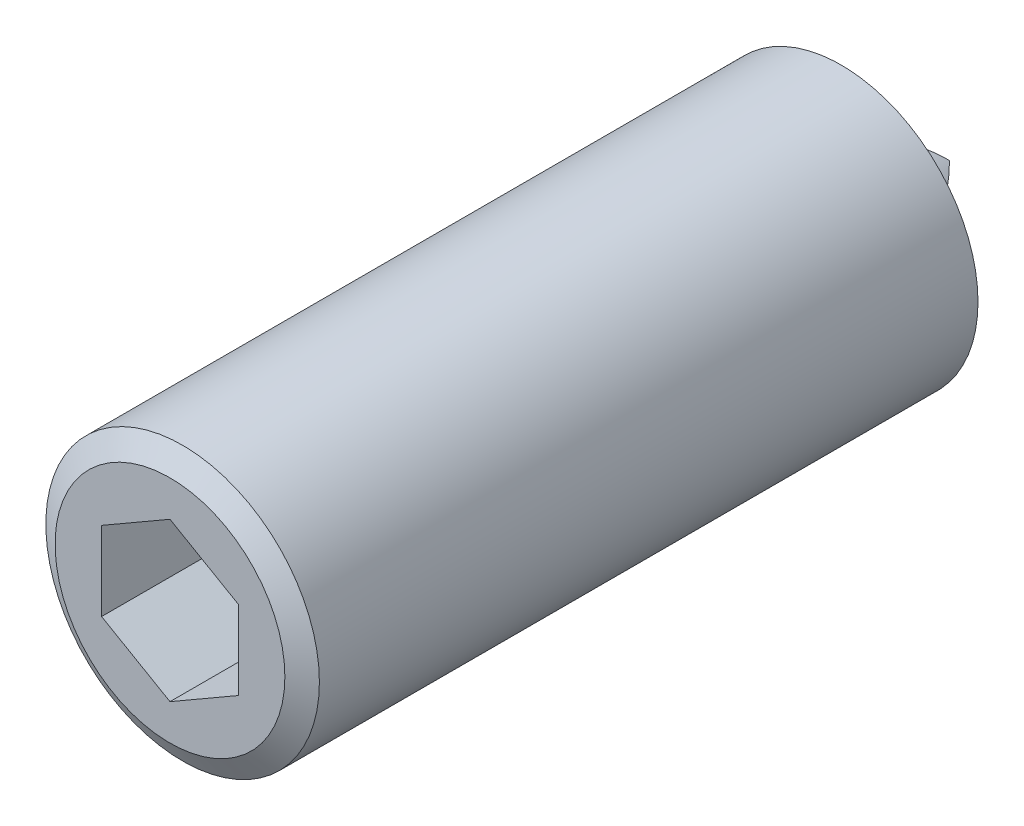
ISO-10303-21;
HEADER;
FILE_DESCRIPTION(('STEP AP214'),'2;1');
FILE_NAME('part.step','',(''),(''),'','','');
FILE_SCHEMA(('AUTOMOTIVE_DESIGN { 1 0 10303 214 1 1 1 1 }'));
ENDSEC;
DATA;
#1=APPLICATION_CONTEXT('core data for automotive mechanical design processes');
#2=APPLICATION_PROTOCOL_DEFINITION('international standard','automotive_design',2000,#1);
#3=PRODUCT_CONTEXT('',#1,'mechanical');
#4=PRODUCT('Part','Part','',(#3));
#5=PRODUCT_RELATED_PRODUCT_CATEGORY('part','',(#4));
#6=PRODUCT_DEFINITION_FORMATION('','',#4);
#7=PRODUCT_DEFINITION_CONTEXT('part definition',#1,'design');
#8=PRODUCT_DEFINITION('design','',#6,#7);
#9=PRODUCT_DEFINITION_SHAPE('','',#8);
#10=(LENGTH_UNIT() NAMED_UNIT(*) SI_UNIT(.MILLI.,.METRE.));
#11=(NAMED_UNIT(*) PLANE_ANGLE_UNIT() SI_UNIT($,.RADIAN.));
#12=(NAMED_UNIT(*) SI_UNIT($,.STERADIAN.) SOLID_ANGLE_UNIT());
#13=UNCERTAINTY_MEASURE_WITH_UNIT(LENGTH_MEASURE(1.E-05),#10,'distance_accuracy_value','');
#14=(GEOMETRIC_REPRESENTATION_CONTEXT(3) GLOBAL_UNCERTAINTY_ASSIGNED_CONTEXT((#13)) GLOBAL_UNIT_ASSIGNED_CONTEXT((#10,
#11,#12)) REPRESENTATION_CONTEXT('',''));
#15=CARTESIAN_POINT('',(0.,0.,0.));
#16=DIRECTION('',(0.,0.,1.));
#17=DIRECTION('',(1.,0.,0.));
#18=AXIS2_PLACEMENT_3D('',#15,#16,#17);
#19=CARTESIAN_POINT('',(0.,-5.,0.));
#20=DIRECTION('',(0.70710678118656,0.,0.707106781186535));
#21=DIRECTION('',(0.707106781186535,0.,-0.70710678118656));
#22=AXIS2_PLACEMENT_3D('',#19,#20,#21);
#23=PLANE('',#22);
#24=DIRECTION('',(0.577350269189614,-0.577350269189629,-0.577350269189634));
#25=VECTOR('',#24,1.);
#26=CARTESIAN_POINT('',(0.899999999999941,-3.20000000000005,-0.9));
#27=LINE('',#26,#25);
#28=CARTESIAN_POINT('',(-1.15,-1.15,1.15));
#29=VERTEX_POINT('',#28);
#30=CARTESIAN_POINT('',(0.,-2.3,0.));
#31=VERTEX_POINT('',#30);
#32=EDGE_CURVE('E234',#29,#31,#27,.T.);
#33=ORIENTED_EDGE('',*,*,#32,.T.);
#34=DIRECTION('',(-0.57735026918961,-0.577350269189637,0.57735026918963));
#35=VECTOR('',#34,1.);
#36=CARTESIAN_POINT('',(-0.90000000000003,-3.2,0.9));
#37=LINE('',#36,#35);
#38=CARTESIAN_POINT('',(-0.798717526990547,-3.09871752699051,0.798717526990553));
#39=VERTEX_POINT('',#38);
#40=EDGE_CURVE('E226',#31,#39,#37,.T.);
#41=ORIENTED_EDGE('',*,*,#40,.T.);
#42=CARTESIAN_POINT('',(0.,0.,0.));
#43=DIRECTION('',(0.70710678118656,0.,0.707106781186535));
#44=DIRECTION('',(-0.707106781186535,0.,0.70710678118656));
#45=AXIS2_PLACEMENT_3D('',#42,#43,#44);
#46=ELLIPSE('',#45,4.52548339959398,3.2);
#47=CARTESIAN_POINT('',(-1.15000000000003,-2.98621834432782,1.15));
#48=VERTEX_POINT('',#47);
#49=EDGE_CURVE('E325',#48,#39,#46,.T.);
#50=ORIENTED_EDGE('',*,*,#49,.F.);
#51=DIRECTION('',(0.,1.,0.));
#52=VECTOR('',#51,1.);
#53=CARTESIAN_POINT('',(-1.15000000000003,-5.,1.15));
#54=LINE('',#53,#52);
#55=EDGE_CURVE('E257',#48,#29,#54,.T.);
#56=ORIENTED_EDGE('',*,*,#55,.T.);
#57=EDGE_LOOP('',(#33,#41,#50,#56));
#58=FACE_BOUND('',#57,.T.);
#59=ADVANCED_FACE('F14',(#58),#23,.F.);
#60=CARTESIAN_POINT('',(-0.798717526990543,3.09871752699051,0.798717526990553));
#61=VERTEX_POINT('',#60);
#62=CARTESIAN_POINT('',(-1.15000000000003,2.98621834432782,1.15));
#63=VERTEX_POINT('',#62);
#64=EDGE_CURVE('E328',#61,#63,#46,.T.);
#65=ORIENTED_EDGE('',*,*,#64,.F.);
#66=DIRECTION('',(0.577350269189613,-0.577350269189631,-0.577350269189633));
#67=VECTOR('',#66,1.);
#68=CARTESIAN_POINT('',(2.43333333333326,-0.1333333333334,-2.4333333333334));
#69=LINE('',#68,#67);
#70=CARTESIAN_POINT('',(0.,2.30000000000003,0.));
#71=VERTEX_POINT('',#70);
#72=EDGE_CURVE('E221',#61,#71,#69,.T.);
#73=ORIENTED_EDGE('',*,*,#72,.T.);
#74=DIRECTION('',(-0.577350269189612,-0.577350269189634,0.577350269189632));
#75=VECTOR('',#74,1.);
#76=CARTESIAN_POINT('',(-2.43333333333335,-0.133333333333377,2.4333333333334));
#77=LINE('',#76,#75);
#78=CARTESIAN_POINT('',(-1.15000000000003,1.15,1.15));
#79=VERTEX_POINT('',#78);
#80=EDGE_CURVE('E211',#71,#79,#77,.T.);
#81=ORIENTED_EDGE('',*,*,#80,.T.);
#82=EDGE_CURVE('E261',#79,#63,#54,.T.);
#83=ORIENTED_EDGE('',*,*,#82,.T.);
#84=EDGE_LOOP('',(#65,#73,#81,#83));
#85=FACE_BOUND('',#84,.T.);
#86=ADVANCED_FACE('F400',(#85),#23,.F.);
#87=CARTESIAN_POINT('',(-1.15000000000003,-5.,1.15));
#88=DIRECTION('',(-0.707106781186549,0.,0.707106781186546));
#89=DIRECTION('',(0.707106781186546,0.,0.707106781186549));
#90=AXIS2_PLACEMENT_3D('',#87,#88,#89);
#91=PLANE('',#90);
#92=CARTESIAN_POINT('',(0.,0.,2.3));
#93=DIRECTION('',(-0.707106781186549,0.,0.707106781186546));
#94=DIRECTION('',(0.707106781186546,0.,0.707106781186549));
#95=AXIS2_PLACEMENT_3D('',#92,#93,#94);
#96=ELLIPSE('',#95,4.52548339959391,3.2);
#97=CARTESIAN_POINT('',(-2.26274169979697,-2.26274169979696,0.0372583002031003));
#98=VERTEX_POINT('',#97);
#99=EDGE_CURVE('E329',#98,#48,#96,.T.);
#100=ORIENTED_EDGE('',*,*,#99,.F.);
#101=DIRECTION('',(0.577350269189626,0.577350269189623,0.577350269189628));
#102=VECTOR('',#101,1.);
#103=CARTESIAN_POINT('',(-2.43333333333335,-2.43333333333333,-0.133333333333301));
#104=LINE('',#103,#102);
#105=EDGE_CURVE('E240',#98,#29,#104,.T.);
#106=ORIENTED_EDGE('',*,*,#105,.T.);
#107=ORIENTED_EDGE('',*,*,#55,.F.);
#108=EDGE_LOOP('',(#100,#106,#107));
#109=FACE_BOUND('',#108,.T.);
#110=ADVANCED_FACE('F406',(#109),#91,.F.);
#111=ORIENTED_EDGE('',*,*,#82,.F.);
#112=DIRECTION('',(-0.577350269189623,0.577350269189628,-0.577350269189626));
#113=VECTOR('',#112,1.);
#114=CARTESIAN_POINT('',(0.89999999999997,-0.900000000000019,3.2));
#115=LINE('',#114,#113);
#116=CARTESIAN_POINT('',(-2.26274169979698,2.26274169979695,0.0372583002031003));
#117=VERTEX_POINT('',#116);
#118=EDGE_CURVE('E217',#79,#117,#115,.T.);
#119=ORIENTED_EDGE('',*,*,#118,.T.);
#120=EDGE_CURVE('E184',#63,#117,#96,.T.);
#121=ORIENTED_EDGE('',*,*,#120,.F.);
#122=EDGE_LOOP('',(#111,#119,#121));
#123=FACE_BOUND('',#122,.T.);
#124=ADVANCED_FACE('F421',(#123),#91,.F.);
#125=CARTESIAN_POINT('',(1.14999999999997,-5.,1.15));
#126=DIRECTION('',(0.707106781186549,0.,0.707106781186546));
#127=DIRECTION('',(0.707106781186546,0.,-0.707106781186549));
#128=AXIS2_PLACEMENT_3D('',#125,#126,#127);
#129=PLANE('',#128);
#130=DIRECTION('',(0.,1.,0.));
#131=VECTOR('',#130,1.);
#132=CARTESIAN_POINT('',(1.14999999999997,-5.,1.15));
#133=LINE('',#132,#131);
#134=CARTESIAN_POINT('',(1.14999999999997,-2.98621834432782,1.15));
#135=VERTEX_POINT('',#134);
#136=CARTESIAN_POINT('',(1.15000000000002,-1.15,1.15));
#137=VERTEX_POINT('',#136);
#138=EDGE_CURVE('E262',#135,#137,#133,.T.);
#139=ORIENTED_EDGE('',*,*,#138,.T.);
#140=DIRECTION('',(0.577350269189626,-0.577350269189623,-0.577350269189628));
#141=VECTOR('',#140,1.);
#142=CARTESIAN_POINT('',(2.43333333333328,-2.43333333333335,-0.133333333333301));
#143=LINE('',#142,#141);
#144=CARTESIAN_POINT('',(2.2627416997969,-2.26274169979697,0.0372583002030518));
#145=VERTEX_POINT('',#144);
#146=EDGE_CURVE('E231',#137,#145,#143,.T.);
#147=ORIENTED_EDGE('',*,*,#146,.T.);
#148=CARTESIAN_POINT('',(0.,0.,2.3));
#149=DIRECTION('',(0.707106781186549,0.,0.707106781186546));
#150=DIRECTION('',(-0.707106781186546,0.,0.707106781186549));
#151=AXIS2_PLACEMENT_3D('',#148,#149,#150);
#152=ELLIPSE('',#151,4.52548339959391,3.2);
#153=EDGE_CURVE('E317',#135,#145,#152,.T.);
#154=ORIENTED_EDGE('',*,*,#153,.F.);
#155=EDGE_LOOP('',(#139,#147,#154));
#156=FACE_BOUND('',#155,.T.);
#157=ADVANCED_FACE('F435',(#156),#129,.F.);
#158=CARTESIAN_POINT('',(2.2627416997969,2.26274169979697,0.0372583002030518));
#159=VERTEX_POINT('',#158);
#160=CARTESIAN_POINT('',(1.14999999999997,2.98621834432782,1.15));
#161=VERTEX_POINT('',#160);
#162=EDGE_CURVE('E322',#159,#161,#152,.T.);
#163=ORIENTED_EDGE('',*,*,#162,.F.);
#164=DIRECTION('',(-0.577350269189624,-0.577350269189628,0.577350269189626));
#165=VECTOR('',#164,1.);
#166=CARTESIAN_POINT('',(-0.900000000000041,-0.9,3.2));
#167=LINE('',#166,#165);
#168=CARTESIAN_POINT('',(1.15,1.15,1.15));
#169=VERTEX_POINT('',#168);
#170=EDGE_CURVE('E208',#159,#169,#167,.T.);
#171=ORIENTED_EDGE('',*,*,#170,.T.);
#172=EDGE_CURVE('E264',#169,#161,#133,.T.);
#173=ORIENTED_EDGE('',*,*,#172,.T.);
#174=EDGE_LOOP('',(#163,#171,#173));
#175=FACE_BOUND('',#174,.T.);
#176=ADVANCED_FACE('F440',(#175),#129,.F.);
#177=CARTESIAN_POINT('',(0.,-5.,0.));
#178=DIRECTION('',(-0.707106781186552,0.,0.707106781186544));
#179=DIRECTION('',(0.707106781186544,0.,0.707106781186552));
#180=AXIS2_PLACEMENT_3D('',#177,#178,#179);
#181=PLANE('',#180);
#182=CARTESIAN_POINT('',(0.,0.,0.));
#183=DIRECTION('',(-0.707106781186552,0.,0.707106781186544));
#184=DIRECTION('',(0.707106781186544,0.,0.707106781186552));
#185=AXIS2_PLACEMENT_3D('',#182,#183,#184);
#186=ELLIPSE('',#185,4.52548339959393,3.2);
#187=CARTESIAN_POINT('',(0.798717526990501,-3.0987175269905,0.798717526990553));
#188=VERTEX_POINT('',#187);
#189=EDGE_CURVE('E315',#188,#135,#186,.T.);
#190=ORIENTED_EDGE('',*,*,#189,.F.);
#191=DIRECTION('',(-0.577350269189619,0.577350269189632,-0.577350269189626));
#192=VECTOR('',#191,1.);
#193=CARTESIAN_POINT('',(0.899999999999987,-3.2,0.9));
#194=LINE('',#193,#192);
#195=EDGE_CURVE('E340',#188,#31,#194,.T.);
#196=ORIENTED_EDGE('',*,*,#195,.T.);
#197=DIRECTION('',(0.577350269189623,0.577350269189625,0.57735026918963));
#198=VECTOR('',#197,1.);
#199=CARTESIAN_POINT('',(-0.9,-3.2,-0.9));
#200=LINE('',#199,#198);
#201=EDGE_CURVE('E189',#31,#137,#200,.T.);
#202=ORIENTED_EDGE('',*,*,#201,.T.);
#203=ORIENTED_EDGE('',*,*,#138,.F.);
#204=EDGE_LOOP('',(#190,#196,#202,#203));
#205=FACE_BOUND('',#204,.T.);
#206=ADVANCED_FACE('F416',(#205),#181,.F.);
#207=DIRECTION('',(-0.577350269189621,0.577350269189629,-0.577350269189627));
#208=VECTOR('',#207,1.);
#209=CARTESIAN_POINT('',(2.43333333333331,-0.133333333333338,2.43333333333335));
#210=LINE('',#209,#208);
#211=EDGE_CURVE('E183',#169,#71,#210,.T.);
#212=ORIENTED_EDGE('',*,*,#211,.T.);
#213=DIRECTION('',(0.577350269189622,0.577350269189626,0.577350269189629));
#214=VECTOR('',#213,1.);
#215=CARTESIAN_POINT('',(-2.43333333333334,-0.133333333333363,-2.43333333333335));
#216=LINE('',#215,#214);
#217=CARTESIAN_POINT('',(0.798717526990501,3.0987175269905,0.798717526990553));
#218=VERTEX_POINT('',#217);
#219=EDGE_CURVE('E190',#71,#218,#216,.T.);
#220=ORIENTED_EDGE('',*,*,#219,.T.);
#221=EDGE_CURVE('E318',#161,#218,#186,.T.);
#222=ORIENTED_EDGE('',*,*,#221,.F.);
#223=ORIENTED_EDGE('',*,*,#172,.F.);
#224=EDGE_LOOP('',(#212,#220,#222,#223));
#225=FACE_BOUND('',#224,.T.);
#226=ADVANCED_FACE('F417',(#225),#181,.F.);
#227=CARTESIAN_POINT('',(0.,0.,46.27));
#228=DIRECTION('',(0.,0.,1.));
#229=DIRECTION('',(1.,0.,0.));
#230=AXIS2_PLACEMENT_3D('',#227,#228,#229);
#231=CYLINDRICAL_SURFACE('',#230,3.2);
#232=CARTESIAN_POINT('',(0.,0.,1.27));
#233=DIRECTION('',(0.,0.,1.));
#234=DIRECTION('',(1.,0.,0.));
#235=AXIS2_PLACEMENT_3D('',#232,#233,#234);
#236=CIRCLE('',#235,3.2);
#237=CARTESIAN_POINT('',(3.19999999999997,0.,1.27));
#238=VERTEX_POINT('',#237);
#239=EDGE_CURVE('E312',#238,#238,#236,.T.);
#240=ORIENTED_EDGE('',*,*,#239,.F.);
#241=EDGE_LOOP('',(#240));
#242=FACE_BOUND('',#241,.T.);
#243=CARTESIAN_POINT('',(0.,0.,-2.3));
#244=DIRECTION('',(0.707106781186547,0.,0.707106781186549));
#245=DIRECTION('',(-0.707106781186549,0.,0.707106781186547));
#246=AXIS2_PLACEMENT_3D('',#243,#244,#245);
#247=ELLIPSE('',#246,4.5254833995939,3.2);
#248=CARTESIAN_POINT('',(-3.09871752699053,0.79871752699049,0.798717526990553));
#249=VERTEX_POINT('',#248);
#250=CARTESIAN_POINT('',(-3.09871752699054,-0.798717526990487,0.798717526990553));
#251=VERTEX_POINT('',#250);
#252=EDGE_CURVE('E331',#249,#251,#247,.T.);
#253=ORIENTED_EDGE('',*,*,#252,.T.);
#254=CARTESIAN_POINT('',(0.,0.,0.));
#255=DIRECTION('',(0.,0.707106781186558,0.707106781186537));
#256=DIRECTION('',(0.,-0.707106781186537,0.707106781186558));
#257=AXIS2_PLACEMENT_3D('',#254,#255,#256);
#258=ELLIPSE('',#257,4.52548339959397,3.2);
#259=CARTESIAN_POINT('',(-2.98621834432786,-1.15,1.15));
#260=VERTEX_POINT('',#259);
#261=EDGE_CURVE('E251',#251,#260,#258,.T.);
#262=ORIENTED_EDGE('',*,*,#261,.T.);
#263=CARTESIAN_POINT('',(0.,0.,2.3));
#264=DIRECTION('',(0.,-0.707106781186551,0.707106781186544));
#265=DIRECTION('',(0.,0.707106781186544,0.707106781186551));
#266=AXIS2_PLACEMENT_3D('',#263,#264,#265);
#267=ELLIPSE('',#266,4.52548339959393,3.2);
#268=EDGE_CURVE('E241',#260,#98,#267,.T.);
#269=ORIENTED_EDGE('',*,*,#268,.T.);
#270=ORIENTED_EDGE('',*,*,#99,.T.);
#271=ORIENTED_EDGE('',*,*,#49,.T.);
#272=CARTESIAN_POINT('',(0.,0.,-2.3));
#273=DIRECTION('',(0.,0.707106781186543,0.707106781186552));
#274=DIRECTION('',(0.,-0.707106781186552,0.707106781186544));
#275=AXIS2_PLACEMENT_3D('',#272,#273,#274);
#276=ELLIPSE('',#275,4.52548339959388,3.2);
#277=EDGE_CURVE('E229',#39,#188,#276,.T.);
#278=ORIENTED_EDGE('',*,*,#277,.T.);
#279=ORIENTED_EDGE('',*,*,#189,.T.);
#280=ORIENTED_EDGE('',*,*,#153,.T.);
#281=CARTESIAN_POINT('',(2.9862183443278,-1.15,1.15));
#282=VERTEX_POINT('',#281);
#283=EDGE_CURVE('E237',#145,#282,#267,.T.);
#284=ORIENTED_EDGE('',*,*,#283,.T.);
#285=CARTESIAN_POINT('',(3.09871752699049,-0.798717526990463,0.798717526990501));
#286=VERTEX_POINT('',#285);
#287=EDGE_CURVE('E167',#282,#286,#258,.T.);
#288=ORIENTED_EDGE('',*,*,#287,.T.);
#289=CARTESIAN_POINT('',(0.,0.,-2.3));
#290=DIRECTION('',(-0.707106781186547,0.,0.707106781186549));
#291=DIRECTION('',(0.707106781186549,0.,0.707106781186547));
#292=AXIS2_PLACEMENT_3D('',#289,#290,#291);
#293=ELLIPSE('',#292,4.5254833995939,3.2);
#294=CARTESIAN_POINT('',(3.09871752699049,0.79871752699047,0.798717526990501));
#295=VERTEX_POINT('',#294);
#296=EDGE_CURVE('E321',#286,#295,#293,.T.);
#297=ORIENTED_EDGE('',*,*,#296,.T.);
#298=CARTESIAN_POINT('',(0.,0.,0.));
#299=DIRECTION('',(0.,-0.707106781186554,0.707106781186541));
#300=DIRECTION('',(0.,0.707106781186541,0.707106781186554));
#301=AXIS2_PLACEMENT_3D('',#298,#299,#300);
#302=ELLIPSE('',#301,4.52548339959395,3.2);
#303=CARTESIAN_POINT('',(2.9862183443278,1.15,1.15));
#304=VERTEX_POINT('',#303);
#305=EDGE_CURVE('E195',#295,#304,#302,.T.);
#306=ORIENTED_EDGE('',*,*,#305,.T.);
#307=CARTESIAN_POINT('',(0.,0.,2.3));
#308=DIRECTION('',(0.,0.707106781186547,0.707106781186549));
#309=DIRECTION('',(0.,-0.707106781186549,0.707106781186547));
#310=AXIS2_PLACEMENT_3D('',#307,#308,#309);
#311=ELLIPSE('',#310,4.5254833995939,3.2);
#312=EDGE_CURVE('E214',#304,#159,#311,.T.);
#313=ORIENTED_EDGE('',*,*,#312,.T.);
#314=ORIENTED_EDGE('',*,*,#162,.T.);
#315=ORIENTED_EDGE('',*,*,#221,.T.);
#316=CARTESIAN_POINT('',(0.,0.,-2.3));
#317=DIRECTION('',(0.,-0.707106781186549,0.707106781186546));
#318=DIRECTION('',(0.,0.707106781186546,0.707106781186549));
#319=AXIS2_PLACEMENT_3D('',#316,#317,#318);
#320=ELLIPSE('',#319,4.52548339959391,3.2);
#321=EDGE_CURVE('E224',#218,#61,#320,.T.);
#322=ORIENTED_EDGE('',*,*,#321,.T.);
#323=ORIENTED_EDGE('',*,*,#64,.T.);
#324=ORIENTED_EDGE('',*,*,#120,.T.);
#325=CARTESIAN_POINT('',(-2.98621834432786,1.15,1.15));
#326=VERTEX_POINT('',#325);
#327=EDGE_CURVE('E218',#117,#326,#311,.T.);
#328=ORIENTED_EDGE('',*,*,#327,.T.);
#329=EDGE_CURVE('E199',#326,#249,#302,.T.);
#330=ORIENTED_EDGE('',*,*,#329,.T.);
#331=EDGE_LOOP('',(#253,#262,#269,#270,#271,#278,#279,#280,#284,#288,#297,#306,#313,#314,#315,
#322,#323,#324,#328,#330));
#332=FACE_BOUND('',#331,.T.);
#333=ADVANCED_FACE('F461',(#242,#332),#231,.T.);
#334=CARTESIAN_POINT('',(5.,0.,1.27));
#335=DIRECTION('',(0.,0.,-1.));
#336=DIRECTION('',(-1.,0.,0.));
#337=AXIS2_PLACEMENT_3D('',#334,#335,#336);
#338=PLANE('',#337);
#339=CARTESIAN_POINT('',(0.,0.,1.27));
#340=DIRECTION('',(0.,0.,-1.));
#341=DIRECTION('',(-1.,0.,0.));
#342=AXIS2_PLACEMENT_3D('',#339,#340,#341);
#343=CIRCLE('',#342,4.2);
#344=CARTESIAN_POINT('',(-4.20000000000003,0.,1.27));
#345=VERTEX_POINT('',#344);
#346=EDGE_CURVE('E9',#345,#345,#343,.T.);
#347=ORIENTED_EDGE('',*,*,#346,.T.);
#348=EDGE_LOOP('',(#347));
#349=FACE_BOUND('',#348,.T.);
#350=ORIENTED_EDGE('',*,*,#239,.T.);
#351=EDGE_LOOP('',(#350));
#352=FACE_BOUND('',#351,.T.);
#353=ADVANCED_FACE('F585',(#349,#352),#338,.T.);
#354=CARTESIAN_POINT('',(0.,0.,46.27));
#355=DIRECTION('',(0.,0.,1.));
#356=DIRECTION('',(1.,0.,0.));
#357=AXIS2_PLACEMENT_3D('',#354,#355,#356);
#358=CYLINDRICAL_SURFACE('',#357,5.);
#359=CARTESIAN_POINT('',(0.,0.,25.8081197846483));
#360=DIRECTION('',(0.,0.,1.));
#361=DIRECTION('',(1.,0.,0.));
#362=AXIS2_PLACEMENT_3D('',#359,#360,#361);
#363=CIRCLE('',#362,5.);
#364=CARTESIAN_POINT('',(4.99999999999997,0.,25.8081197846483));
#365=VERTEX_POINT('',#364);
#366=EDGE_CURVE('E22',#365,#365,#363,.F.);
#367=ORIENTED_EDGE('',*,*,#366,.T.);
#368=EDGE_LOOP('',(#367));
#369=FACE_BOUND('',#368,.T.);
#370=CARTESIAN_POINT('',(0.,0.,1.7318802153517));
#371=DIRECTION('',(0.,0.,-1.));
#372=DIRECTION('',(-1.,0.,0.));
#373=AXIS2_PLACEMENT_3D('',#370,#371,#372);
#374=CIRCLE('',#373,5.);
#375=CARTESIAN_POINT('',(-5.00000000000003,0.,1.7318802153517));
#376=VERTEX_POINT('',#375);
#377=EDGE_CURVE('E346',#376,#376,#374,.F.);
#378=ORIENTED_EDGE('',*,*,#377,.T.);
#379=EDGE_LOOP('',(#378));
#380=FACE_BOUND('',#379,.T.);
#381=ADVANCED_FACE('F351',(#369,#380),#358,.T.);
#382=CARTESIAN_POINT('',(0.,0.,26.27));
#383=DIRECTION('',(0.,0.,1.));
#384=DIRECTION('',(1.,0.,0.));
#385=AXIS2_PLACEMENT_3D('',#382,#383,#384);
#386=PLANE('',#385);
#387=CARTESIAN_POINT('',(0.,0.,26.27));
#388=DIRECTION('',(0.,0.,1.));
#389=DIRECTION('',(1.,0.,0.));
#390=AXIS2_PLACEMENT_3D('',#387,#388,#389);
#391=CIRCLE('',#390,4.2);
#392=CARTESIAN_POINT('',(4.19999999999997,0.,26.27));
#393=VERTEX_POINT('',#392);
#394=EDGE_CURVE('E343',#393,#393,#391,.T.);
#395=ORIENTED_EDGE('',*,*,#394,.T.);
#396=EDGE_LOOP('',(#395));
#397=FACE_BOUND('',#396,.T.);
#398=DIRECTION('',(0.86602540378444,-0.5,0.));
#399=VECTOR('',#398,1.);
#400=CARTESIAN_POINT('',(-2.5,-1.44337567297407,26.27));
#401=LINE('',#400,#399);
#402=CARTESIAN_POINT('',(-2.5,-1.44337567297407,26.27));
#403=VERTEX_POINT('',#402);
#404=CARTESIAN_POINT('',(0.,-2.88675134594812,26.27));
#405=VERTEX_POINT('',#404);
#406=EDGE_CURVE('E260',#403,#405,#401,.T.);
#407=ORIENTED_EDGE('',*,*,#406,.F.);
#408=DIRECTION('',(0.,-1.,0.));
#409=VECTOR('',#408,1.);
#410=CARTESIAN_POINT('',(-2.5,1.44337567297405,26.27));
#411=LINE('',#410,#409);
#412=CARTESIAN_POINT('',(-2.5,1.44337567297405,26.27));
#413=VERTEX_POINT('',#412);
#414=EDGE_CURVE('E278',#413,#403,#411,.T.);
#415=ORIENTED_EDGE('',*,*,#414,.F.);
#416=DIRECTION('',(0.866025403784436,0.5,0.));
#417=VECTOR('',#416,1.);
#418=CARTESIAN_POINT('',(-2.5,1.44337567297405,26.27));
#419=LINE('',#418,#417);
#420=CARTESIAN_POINT('',(0.,2.88675134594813,26.27));
#421=VERTEX_POINT('',#420);
#422=EDGE_CURVE('E275',#413,#421,#419,.T.);
#423=ORIENTED_EDGE('',*,*,#422,.T.);
#424=DIRECTION('',(-0.866025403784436,0.5,0.));
#425=VECTOR('',#424,1.);
#426=CARTESIAN_POINT('',(2.49999999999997,1.44337567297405,26.27));
#427=LINE('',#426,#425);
#428=CARTESIAN_POINT('',(2.49999999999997,1.44337567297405,26.27));
#429=VERTEX_POINT('',#428);
#430=EDGE_CURVE('E272',#429,#421,#427,.T.);
#431=ORIENTED_EDGE('',*,*,#430,.F.);
#432=DIRECTION('',(0.,-1.,0.));
#433=VECTOR('',#432,1.);
#434=CARTESIAN_POINT('',(2.49999999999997,1.44337567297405,26.27));
#435=LINE('',#434,#433);
#436=CARTESIAN_POINT('',(2.49999999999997,-1.44337567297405,26.27));
#437=VERTEX_POINT('',#436);
#438=EDGE_CURVE('E269',#429,#437,#435,.T.);
#439=ORIENTED_EDGE('',*,*,#438,.T.);
#440=DIRECTION('',(-0.866025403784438,-0.5,0.));
#441=VECTOR('',#440,1.);
#442=CARTESIAN_POINT('',(2.49999999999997,-1.44337567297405,26.27));
#443=LINE('',#442,#441);
#444=EDGE_CURVE('E266',#437,#405,#443,.T.);
#445=ORIENTED_EDGE('',*,*,#444,.T.);
#446=EDGE_LOOP('',(#407,#415,#423,#431,#439,#445));
#447=FACE_BOUND('',#446,.T.);
#448=ADVANCED_FACE('F360',(#397,#447),#386,.T.);
#449=CARTESIAN_POINT('',(-2.5,-1.44337567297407,22.27));
#450=DIRECTION('',(-0.5,-0.86602540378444,0.));
#451=DIRECTION('',(-0.86602540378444,0.5,0.));
#452=AXIS2_PLACEMENT_3D('',#449,#450,#451);
#453=PLANE('',#452);
#454=DIRECTION('',(0.,0.,1.));
#455=VECTOR('',#454,1.);
#456=CARTESIAN_POINT('',(-2.5,-1.44337567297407,22.27));
#457=LINE('',#456,#455);
#458=CARTESIAN_POINT('',(-2.5,-1.44337567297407,22.27));
#459=VERTEX_POINT('',#458);
#460=EDGE_CURVE('E310',#459,#403,#457,.T.);
#461=ORIENTED_EDGE('',*,*,#460,.T.);
#462=ORIENTED_EDGE('',*,*,#406,.T.);
#463=DIRECTION('',(0.,0.,1.));
#464=VECTOR('',#463,1.);
#465=CARTESIAN_POINT('',(0.,-2.88675134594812,22.27));
#466=LINE('',#465,#464);
#467=CARTESIAN_POINT('',(0.,-2.88675134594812,22.27));
#468=VERTEX_POINT('',#467);
#469=EDGE_CURVE('E299',#468,#405,#466,.T.);
#470=ORIENTED_EDGE('',*,*,#469,.F.);
#471=DIRECTION('',(0.86602540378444,-0.5,0.));
#472=VECTOR('',#471,1.);
#473=CARTESIAN_POINT('',(-2.5,-1.44337567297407,22.27));
#474=LINE('',#473,#472);
#475=EDGE_CURVE('E281',#459,#468,#474,.T.);
#476=ORIENTED_EDGE('',*,*,#475,.F.);
#477=EDGE_LOOP('',(#461,#462,#470,#476));
#478=FACE_BOUND('',#477,.T.);
#479=ADVANCED_FACE('F363',(#478),#453,.F.);
#480=CARTESIAN_POINT('',(-2.5,1.44337567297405,22.27));
#481=DIRECTION('',(-1.,0.,0.));
#482=DIRECTION('',(0.,0.,1.));
#483=AXIS2_PLACEMENT_3D('',#480,#481,#482);
#484=PLANE('',#483);
#485=DIRECTION('',(0.,0.,1.));
#486=VECTOR('',#485,1.);
#487=CARTESIAN_POINT('',(-2.5,1.44337567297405,22.27));
#488=LINE('',#487,#486);
#489=CARTESIAN_POINT('',(-2.5,1.44337567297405,22.27));
#490=VERTEX_POINT('',#489);
#491=EDGE_CURVE('E308',#490,#413,#488,.T.);
#492=ORIENTED_EDGE('',*,*,#491,.T.);
#493=ORIENTED_EDGE('',*,*,#414,.T.);
#494=ORIENTED_EDGE('',*,*,#460,.F.);
#495=DIRECTION('',(0.,-1.,0.));
#496=VECTOR('',#495,1.);
#497=CARTESIAN_POINT('',(-2.5,1.44337567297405,22.27));
#498=LINE('',#497,#496);
#499=EDGE_CURVE('E296',#490,#459,#498,.T.);
#500=ORIENTED_EDGE('',*,*,#499,.F.);
#501=EDGE_LOOP('',(#492,#493,#494,#500));
#502=FACE_BOUND('',#501,.T.);
#503=ADVANCED_FACE('F389',(#502),#484,.F.);
#504=CARTESIAN_POINT('',(-2.5,1.44337567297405,22.27));
#505=DIRECTION('',(0.5,-0.866025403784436,0.));
#506=DIRECTION('',(-0.866025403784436,-0.5,0.));
#507=AXIS2_PLACEMENT_3D('',#504,#505,#506);
#508=PLANE('',#507);
#509=DIRECTION('',(0.,0.,1.));
#510=VECTOR('',#509,1.);
#511=CARTESIAN_POINT('',(0.,2.88675134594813,22.27));
#512=LINE('',#511,#510);
#513=CARTESIAN_POINT('',(0.,2.88675134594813,22.27));
#514=VERTEX_POINT('',#513);
#515=EDGE_CURVE('E306',#514,#421,#512,.T.);
#516=ORIENTED_EDGE('',*,*,#515,.T.);
#517=ORIENTED_EDGE('',*,*,#422,.F.);
#518=ORIENTED_EDGE('',*,*,#491,.F.);
#519=DIRECTION('',(0.866025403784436,0.5,0.));
#520=VECTOR('',#519,1.);
#521=CARTESIAN_POINT('',(-2.5,1.44337567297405,22.27));
#522=LINE('',#521,#520);
#523=EDGE_CURVE('E293',#490,#514,#522,.T.);
#524=ORIENTED_EDGE('',*,*,#523,.T.);
#525=EDGE_LOOP('',(#516,#517,#518,#524));
#526=FACE_BOUND('',#525,.T.);
#527=ADVANCED_FACE('F386',(#526),#508,.T.);
#528=CARTESIAN_POINT('',(2.49999999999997,1.44337567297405,22.27));
#529=DIRECTION('',(0.5,0.866025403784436,0.));
#530=DIRECTION('',(0.866025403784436,-0.5,0.));
#531=AXIS2_PLACEMENT_3D('',#528,#529,#530);
#532=PLANE('',#531);
#533=DIRECTION('',(0.,0.,1.));
#534=VECTOR('',#533,1.);
#535=CARTESIAN_POINT('',(2.49999999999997,1.44337567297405,22.27));
#536=LINE('',#535,#534);
#537=CARTESIAN_POINT('',(2.49999999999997,1.44337567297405,22.27));
#538=VERTEX_POINT('',#537);
#539=EDGE_CURVE('E304',#538,#429,#536,.T.);
#540=ORIENTED_EDGE('',*,*,#539,.T.);
#541=ORIENTED_EDGE('',*,*,#430,.T.);
#542=ORIENTED_EDGE('',*,*,#515,.F.);
#543=DIRECTION('',(-0.866025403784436,0.5,0.));
#544=VECTOR('',#543,1.);
#545=CARTESIAN_POINT('',(2.49999999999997,1.44337567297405,22.27));
#546=LINE('',#545,#544);
#547=EDGE_CURVE('E290',#538,#514,#546,.T.);
#548=ORIENTED_EDGE('',*,*,#547,.F.);
#549=EDGE_LOOP('',(#540,#541,#542,#548));
#550=FACE_BOUND('',#549,.T.);
#551=ADVANCED_FACE('F382',(#550),#532,.F.);
#552=CARTESIAN_POINT('',(2.49999999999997,1.44337567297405,22.27));
#553=DIRECTION('',(-1.,0.,0.));
#554=DIRECTION('',(0.,0.,1.));
#555=AXIS2_PLACEMENT_3D('',#552,#553,#554);
#556=PLANE('',#555);
#557=DIRECTION('',(0.,0.,1.));
#558=VECTOR('',#557,1.);
#559=CARTESIAN_POINT('',(2.49999999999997,-1.44337567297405,22.27));
#560=LINE('',#559,#558);
#561=CARTESIAN_POINT('',(2.49999999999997,-1.44337567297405,22.27));
#562=VERTEX_POINT('',#561);
#563=EDGE_CURVE('E302',#562,#437,#560,.T.);
#564=ORIENTED_EDGE('',*,*,#563,.T.);
#565=ORIENTED_EDGE('',*,*,#438,.F.);
#566=ORIENTED_EDGE('',*,*,#539,.F.);
#567=DIRECTION('',(0.,-1.,0.));
#568=VECTOR('',#567,1.);
#569=CARTESIAN_POINT('',(2.49999999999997,1.44337567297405,22.27));
#570=LINE('',#569,#568);
#571=EDGE_CURVE('E287',#538,#562,#570,.T.);
#572=ORIENTED_EDGE('',*,*,#571,.T.);
#573=EDGE_LOOP('',(#564,#565,#566,#572));
#574=FACE_BOUND('',#573,.T.);
#575=ADVANCED_FACE('F378',(#574),#556,.T.);
#576=CARTESIAN_POINT('',(2.49999999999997,-1.44337567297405,22.27));
#577=DIRECTION('',(-0.5,0.866025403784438,0.));
#578=DIRECTION('',(0.866025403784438,0.5,0.));
#579=AXIS2_PLACEMENT_3D('',#576,#577,#578);
#580=PLANE('',#579);
#581=DIRECTION('',(-0.866025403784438,-0.5,0.));
#582=VECTOR('',#581,1.);
#583=CARTESIAN_POINT('',(2.49999999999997,-1.44337567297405,22.27));
#584=LINE('',#583,#582);
#585=EDGE_CURVE('E284',#562,#468,#584,.T.);
#586=ORIENTED_EDGE('',*,*,#585,.T.);
#587=ORIENTED_EDGE('',*,*,#469,.T.);
#588=ORIENTED_EDGE('',*,*,#444,.F.);
#589=ORIENTED_EDGE('',*,*,#563,.F.);
#590=EDGE_LOOP('',(#586,#587,#588,#589));
#591=FACE_BOUND('',#590,.T.);
#592=ADVANCED_FACE('F371',(#591),#580,.T.);
#593=CARTESIAN_POINT('',(-5.,0.,22.27));
#594=DIRECTION('',(0.,0.,1.));
#595=DIRECTION('',(1.,0.,0.));
#596=AXIS2_PLACEMENT_3D('',#593,#594,#595);
#597=PLANE('',#596);
#598=ORIENTED_EDGE('',*,*,#475,.T.);
#599=ORIENTED_EDGE('',*,*,#585,.F.);
#600=ORIENTED_EDGE('',*,*,#571,.F.);
#601=ORIENTED_EDGE('',*,*,#547,.T.);
#602=ORIENTED_EDGE('',*,*,#523,.F.);
#603=ORIENTED_EDGE('',*,*,#499,.T.);
#604=EDGE_LOOP('',(#598,#599,#600,#601,#602,#603));
#605=FACE_BOUND('',#604,.T.);
#606=ADVANCED_FACE('F375',(#605),#597,.T.);
#607=CARTESIAN_POINT('',(-2.30000000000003,-5.,0.));
#608=DIRECTION('',(0.707106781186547,0.,0.707106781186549));
#609=DIRECTION('',(0.707106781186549,0.,-0.707106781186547));
#610=AXIS2_PLACEMENT_3D('',#607,#608,#609);
#611=PLANE('',#610);
#612=DIRECTION('',(0.57735026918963,-0.577350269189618,-0.577350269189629));
#613=VECTOR('',#612,1.);
#614=CARTESIAN_POINT('',(-0.633333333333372,-1.66666666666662,-1.66666666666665));
#615=LINE('',#614,#613);
#616=CARTESIAN_POINT('',(-2.30000000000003,0.,0.));
#617=VERTEX_POINT('',#616);
#618=EDGE_CURVE('E205',#249,#617,#615,.T.);
#619=ORIENTED_EDGE('',*,*,#618,.T.);
#620=DIRECTION('',(-0.577350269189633,-0.577350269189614,0.577350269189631));
#621=VECTOR('',#620,1.);
#622=CARTESIAN_POINT('',(-3.96666666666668,-1.6666666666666,1.66666666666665));
#623=LINE('',#622,#621);
#624=EDGE_CURVE('E254',#617,#251,#623,.T.);
#625=ORIENTED_EDGE('',*,*,#624,.T.);
#626=ORIENTED_EDGE('',*,*,#252,.F.);
#627=EDGE_LOOP('',(#619,#625,#626));
#628=FACE_BOUND('',#627,.T.);
#629=ADVANCED_FACE('F494',(#628),#611,.F.);
#630=CARTESIAN_POINT('',(2.29999999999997,-5.,0.));
#631=DIRECTION('',(-0.707106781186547,0.,0.707106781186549));
#632=DIRECTION('',(0.707106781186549,0.,0.707106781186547));
#633=AXIS2_PLACEMENT_3D('',#630,#631,#632);
#634=PLANE('',#633);
#635=ORIENTED_EDGE('',*,*,#296,.F.);
#636=DIRECTION('',(-0.577350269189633,0.577350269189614,-0.577350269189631));
#637=VECTOR('',#636,1.);
#638=CARTESIAN_POINT('',(3.96666666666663,-1.66666666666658,1.66666666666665));
#639=LINE('',#638,#637);
#640=CARTESIAN_POINT('',(2.29999999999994,0.,0.));
#641=VERTEX_POINT('',#640);
#642=EDGE_CURVE('E168',#286,#641,#639,.T.);
#643=ORIENTED_EDGE('',*,*,#642,.T.);
#644=DIRECTION('',(0.57735026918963,0.577350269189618,0.577350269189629));
#645=VECTOR('',#644,1.);
#646=CARTESIAN_POINT('',(0.633333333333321,-1.66666666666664,-1.66666666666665));
#647=LINE('',#646,#645);
#648=EDGE_CURVE('E37',#641,#295,#647,.T.);
#649=ORIENTED_EDGE('',*,*,#648,.T.);
#650=EDGE_LOOP('',(#635,#643,#649));
#651=FACE_BOUND('',#650,.T.);
#652=ADVANCED_FACE('F492',(#651),#634,.F.);
#653=CARTESIAN_POINT('',(5.,0.,0.));
#654=DIRECTION('',(0.,-0.707106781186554,0.707106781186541));
#655=DIRECTION('',(0.,0.707106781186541,0.707106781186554));
#656=AXIS2_PLACEMENT_3D('',#653,#654,#655);
#657=PLANE('',#656);
#658=DIRECTION('',(-1.,0.,0.));
#659=VECTOR('',#658,1.);
#660=CARTESIAN_POINT('',(5.,1.15,1.15));
#661=LINE('',#660,#659);
#662=EDGE_CURVE('E178',#169,#79,#661,.T.);
#663=ORIENTED_EDGE('',*,*,#662,.F.);
#664=DIRECTION('',(0.577350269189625,0.577350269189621,0.577350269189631));
#665=VECTOR('',#664,1.);
#666=CARTESIAN_POINT('',(-1.66666666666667,-1.66666666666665,-1.66666666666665));
#667=LINE('',#666,#665);
#668=CARTESIAN_POINT('',(0.,0.,0.));
#669=VERTEX_POINT('',#668);
#670=EDGE_CURVE('E174',#669,#169,#667,.T.);
#671=ORIENTED_EDGE('',*,*,#670,.F.);
#672=DIRECTION('',(0.577350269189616,-0.577350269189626,-0.577350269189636));
#673=VECTOR('',#672,1.);
#674=CARTESIAN_POINT('',(1.6666666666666,-1.66666666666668,-1.6666666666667));
#675=LINE('',#674,#673);
#676=EDGE_CURVE('E176',#79,#669,#675,.T.);
#677=ORIENTED_EDGE('',*,*,#676,.F.);
#678=EDGE_LOOP('',(#663,#671,#677));
#679=FACE_BOUND('',#678,.T.);
#680=ADVANCED_FACE('F175',(#679),#657,.F.);
#681=CARTESIAN_POINT('',(5.,1.15,1.15));
#682=DIRECTION('',(0.,0.707106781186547,0.707106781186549));
#683=DIRECTION('',(0.,0.707106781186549,-0.707106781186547));
#684=AXIS2_PLACEMENT_3D('',#681,#682,#683);
#685=PLANE('',#684);
#686=ORIENTED_EDGE('',*,*,#211,.F.);
#687=ORIENTED_EDGE('',*,*,#662,.T.);
#688=ORIENTED_EDGE('',*,*,#80,.F.);
#689=EDGE_LOOP('',(#686,#687,#688));
#690=FACE_BOUND('',#689,.T.);
#691=ADVANCED_FACE('F470',(#690),#685,.F.);
#692=CARTESIAN_POINT('',(5.,2.3,0.));
#693=DIRECTION('',(0.,-0.707106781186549,0.707106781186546));
#694=DIRECTION('',(0.,0.707106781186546,0.707106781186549));
#695=AXIS2_PLACEMENT_3D('',#692,#693,#694);
#696=PLANE('',#695);
#697=ORIENTED_EDGE('',*,*,#321,.F.);
#698=ORIENTED_EDGE('',*,*,#219,.F.);
#699=ORIENTED_EDGE('',*,*,#72,.F.);
#700=EDGE_LOOP('',(#697,#698,#699));
#701=FACE_BOUND('',#700,.T.);
#702=ADVANCED_FACE('F466',(#701),#696,.F.);
#703=CARTESIAN_POINT('',(5.,-2.3,0.));
#704=DIRECTION('',(0.,0.707106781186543,0.707106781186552));
#705=DIRECTION('',(0.,0.707106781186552,-0.707106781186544));
#706=AXIS2_PLACEMENT_3D('',#703,#704,#705);
#707=PLANE('',#706);
#708=ORIENTED_EDGE('',*,*,#277,.F.);
#709=ORIENTED_EDGE('',*,*,#40,.F.);
#710=ORIENTED_EDGE('',*,*,#195,.F.);
#711=EDGE_LOOP('',(#708,#709,#710));
#712=FACE_BOUND('',#711,.T.);
#713=ADVANCED_FACE('F727',(#712),#707,.F.);
#714=CARTESIAN_POINT('',(5.,-1.15,1.15));
#715=DIRECTION('',(0.,-0.707106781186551,0.707106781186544));
#716=DIRECTION('',(0.,0.707106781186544,0.707106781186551));
#717=AXIS2_PLACEMENT_3D('',#714,#715,#716);
#718=PLANE('',#717);
#719=DIRECTION('',(-1.,0.,0.));
#720=VECTOR('',#719,1.);
#721=CARTESIAN_POINT('',(5.,-1.15,1.15));
#722=LINE('',#721,#720);
#723=EDGE_CURVE('E162',#137,#29,#722,.T.);
#724=ORIENTED_EDGE('',*,*,#723,.F.);
#725=ORIENTED_EDGE('',*,*,#201,.F.);
#726=ORIENTED_EDGE('',*,*,#32,.F.);
#727=EDGE_LOOP('',(#724,#725,#726));
#728=FACE_BOUND('',#727,.T.);
#729=ADVANCED_FACE('F429',(#728),#718,.F.);
#730=CARTESIAN_POINT('',(5.,0.,0.));
#731=DIRECTION('',(0.,0.707106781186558,0.707106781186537));
#732=DIRECTION('',(0.,0.707106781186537,-0.707106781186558));
#733=AXIS2_PLACEMENT_3D('',#730,#731,#732);
#734=PLANE('',#733);
#735=DIRECTION('',(-0.577350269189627,0.577350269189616,-0.577350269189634));
#736=VECTOR('',#735,1.);
#737=CARTESIAN_POINT('',(1.66666666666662,-1.6666666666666,1.66666666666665));
#738=LINE('',#737,#736);
#739=EDGE_CURVE('E160',#137,#669,#738,.T.);
#740=ORIENTED_EDGE('',*,*,#739,.F.);
#741=ORIENTED_EDGE('',*,*,#723,.T.);
#742=DIRECTION('',(-0.577350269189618,-0.577350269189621,0.577350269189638));
#743=VECTOR('',#742,1.);
#744=CARTESIAN_POINT('',(-1.66666666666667,-1.66666666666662,1.6666666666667));
#745=LINE('',#744,#743);
#746=EDGE_CURVE('E156',#669,#29,#745,.T.);
#747=ORIENTED_EDGE('',*,*,#746,.F.);
#748=EDGE_LOOP('',(#740,#741,#747));
#749=FACE_BOUND('',#748,.T.);
#750=ADVANCED_FACE('F158',(#749),#734,.F.);
#751=ORIENTED_EDGE('',*,*,#648,.F.);
#752=DIRECTION('',(0.577350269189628,-0.57735026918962,-0.57735026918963));
#753=VECTOR('',#752,1.);
#754=CARTESIAN_POINT('',(3.2,-0.899999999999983,-0.9));
#755=LINE('',#754,#753);
#756=EDGE_CURVE('E200',#169,#641,#755,.T.);
#757=ORIENTED_EDGE('',*,*,#756,.F.);
#758=EDGE_CURVE('E458',#304,#169,#661,.T.);
#759=ORIENTED_EDGE('',*,*,#758,.F.);
#760=ORIENTED_EDGE('',*,*,#305,.F.);
#761=EDGE_LOOP('',(#751,#757,#759,#760));
#762=FACE_BOUND('',#761,.T.);
#763=ADVANCED_FACE('F501',(#762),#657,.F.);
#764=ORIENTED_EDGE('',*,*,#758,.T.);
#765=ORIENTED_EDGE('',*,*,#170,.F.);
#766=ORIENTED_EDGE('',*,*,#312,.F.);
#767=EDGE_LOOP('',(#764,#765,#766));
#768=FACE_BOUND('',#767,.T.);
#769=ADVANCED_FACE('F513',(#768),#685,.F.);
#770=ORIENTED_EDGE('',*,*,#146,.F.);
#771=EDGE_CURVE('E475',#282,#137,#722,.T.);
#772=ORIENTED_EDGE('',*,*,#771,.F.);
#773=ORIENTED_EDGE('',*,*,#283,.F.);
#774=EDGE_LOOP('',(#770,#772,#773));
#775=FACE_BOUND('',#774,.T.);
#776=ADVANCED_FACE('F428',(#775),#718,.F.);
#777=ORIENTED_EDGE('',*,*,#771,.T.);
#778=DIRECTION('',(-0.57735026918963,-0.577350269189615,0.577350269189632));
#779=VECTOR('',#778,1.);
#780=CARTESIAN_POINT('',(-0.13333333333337,-2.43333333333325,2.43333333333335));
#781=LINE('',#780,#779);
#782=EDGE_CURVE('E243',#641,#137,#781,.T.);
#783=ORIENTED_EDGE('',*,*,#782,.F.);
#784=ORIENTED_EDGE('',*,*,#642,.F.);
#785=ORIENTED_EDGE('',*,*,#287,.F.);
#786=EDGE_LOOP('',(#777,#783,#784,#785));
#787=FACE_BOUND('',#786,.T.);
#788=ADVANCED_FACE('F489',(#787),#734,.F.);
#789=EDGE_CURVE('E452',#79,#326,#661,.T.);
#790=ORIENTED_EDGE('',*,*,#789,.F.);
#791=DIRECTION('',(0.577350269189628,0.57735026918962,0.57735026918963));
#792=VECTOR('',#791,1.);
#793=CARTESIAN_POINT('',(-3.2,-0.899999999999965,-0.9));
#794=LINE('',#793,#792);
#795=EDGE_CURVE('E29',#617,#79,#794,.T.);
#796=ORIENTED_EDGE('',*,*,#795,.F.);
#797=ORIENTED_EDGE('',*,*,#618,.F.);
#798=ORIENTED_EDGE('',*,*,#329,.F.);
#799=EDGE_LOOP('',(#790,#796,#797,#798));
#800=FACE_BOUND('',#799,.T.);
#801=ADVANCED_FACE('F453',(#800),#657,.F.);
#802=ORIENTED_EDGE('',*,*,#118,.F.);
#803=ORIENTED_EDGE('',*,*,#789,.T.);
#804=ORIENTED_EDGE('',*,*,#327,.F.);
#805=EDGE_LOOP('',(#802,#803,#804));
#806=FACE_BOUND('',#805,.T.);
#807=ADVANCED_FACE('F459',(#806),#685,.F.);
#808=ORIENTED_EDGE('',*,*,#624,.F.);
#809=DIRECTION('',(-0.57735026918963,0.577350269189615,-0.577350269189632));
#810=VECTOR('',#809,1.);
#811=CARTESIAN_POINT('',(0.133333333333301,-2.43333333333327,2.43333333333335));
#812=LINE('',#811,#810);
#813=EDGE_CURVE('E250',#29,#617,#812,.T.);
#814=ORIENTED_EDGE('',*,*,#813,.F.);
#815=EDGE_CURVE('E472',#29,#260,#722,.T.);
#816=ORIENTED_EDGE('',*,*,#815,.T.);
#817=ORIENTED_EDGE('',*,*,#261,.F.);
#818=EDGE_LOOP('',(#808,#814,#816,#817));
#819=FACE_BOUND('',#818,.T.);
#820=ADVANCED_FACE('F425',(#819),#734,.F.);
#821=ORIENTED_EDGE('',*,*,#815,.F.);
#822=ORIENTED_EDGE('',*,*,#105,.F.);
#823=ORIENTED_EDGE('',*,*,#268,.F.);
#824=EDGE_LOOP('',(#821,#822,#823));
#825=FACE_BOUND('',#824,.T.);
#826=ADVANCED_FACE('F418',(#825),#718,.F.);
#827=EDGE_CURVE('E194',#29,#79,#54,.T.);
#828=ORIENTED_EDGE('',*,*,#827,.F.);
#829=ORIENTED_EDGE('',*,*,#813,.T.);
#830=ORIENTED_EDGE('',*,*,#795,.T.);
#831=EDGE_LOOP('',(#828,#829,#830));
#832=FACE_BOUND('',#831,.T.);
#833=ADVANCED_FACE('F411',(#832),#91,.F.);
#834=ORIENTED_EDGE('',*,*,#676,.T.);
#835=ORIENTED_EDGE('',*,*,#746,.T.);
#836=ORIENTED_EDGE('',*,*,#827,.T.);
#837=EDGE_LOOP('',(#834,#835,#836));
#838=FACE_BOUND('',#837,.T.);
#839=ADVANCED_FACE('F192',(#838),#23,.F.);
#840=EDGE_CURVE('E187',#137,#169,#133,.T.);
#841=ORIENTED_EDGE('',*,*,#840,.F.);
#842=ORIENTED_EDGE('',*,*,#739,.T.);
#843=ORIENTED_EDGE('',*,*,#670,.T.);
#844=EDGE_LOOP('',(#841,#842,#843));
#845=FACE_BOUND('',#844,.T.);
#846=ADVANCED_FACE('F186',(#845),#181,.F.);
#847=ORIENTED_EDGE('',*,*,#756,.T.);
#848=ORIENTED_EDGE('',*,*,#782,.T.);
#849=ORIENTED_EDGE('',*,*,#840,.T.);
#850=EDGE_LOOP('',(#847,#848,#849));
#851=FACE_BOUND('',#850,.T.);
#852=ADVANCED_FACE('F357',(#851),#129,.F.);
#853=CARTESIAN_POINT('',(0.,0.,26.27));
#854=DIRECTION('',(0.,0.,-1.));
#855=DIRECTION('',(-1.,0.,0.));
#856=AXIS2_PLACEMENT_3D('',#853,#854,#855);
#857=CONICAL_SURFACE('',#856,4.2,1.0471975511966);
#858=ORIENTED_EDGE('',*,*,#366,.F.);
#859=EDGE_LOOP('',(#858));
#860=FACE_BOUND('',#859,.T.);
#861=ORIENTED_EDGE('',*,*,#394,.F.);
#862=EDGE_LOOP('',(#861));
#863=FACE_BOUND('',#862,.T.);
#864=ADVANCED_FACE('F354',(#860,#863),#857,.T.);
#865=CARTESIAN_POINT('',(0.,0.,1.7318802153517));
#866=DIRECTION('',(0.,0.,1.));
#867=DIRECTION('',(1.,0.,0.));
#868=AXIS2_PLACEMENT_3D('',#865,#866,#867);
#869=CONICAL_SURFACE('',#868,5.,1.0471975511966);
#870=ORIENTED_EDGE('',*,*,#346,.F.);
#871=EDGE_LOOP('',(#870));
#872=FACE_BOUND('',#871,.T.);
#873=ORIENTED_EDGE('',*,*,#377,.F.);
#874=EDGE_LOOP('',(#873));
#875=FACE_BOUND('',#874,.T.);
#876=ADVANCED_FACE('F16',(#872,#875),#869,.T.);
#877=CLOSED_SHELL('',(#59,#86,#110,#124,#157,#176,#206,#226,#333,#353,#381,#448,#479,#503,#527,
#551,#575,#592,#606,#629,#652,#680,#691,#702,#713,#729,#750,#763,#769,#776,#788,#801,#807,#820,
#826,#833,#839,#846,#852,#864,#876));
#878=MANIFOLD_SOLID_BREP('B1',#877);
#879=ADVANCED_BREP_SHAPE_REPRESENTATION('',(#18,#878),#14);
#880=SHAPE_DEFINITION_REPRESENTATION(#9,#879);
ENDSEC;
END-ISO-10303-21;
